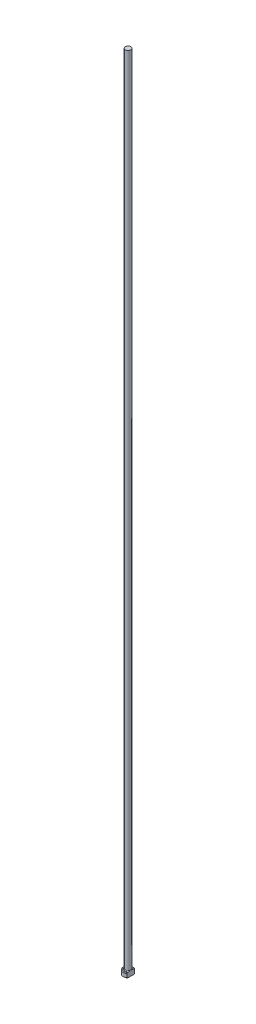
ISO-10303-21;
HEADER;
FILE_DESCRIPTION(('STEP AP214'),'2;1');
FILE_NAME('part.step','',(''),(''),'','','');
FILE_SCHEMA(('AUTOMOTIVE_DESIGN { 1 0 10303 214 1 1 1 1 }'));
ENDSEC;
DATA;
#1=APPLICATION_CONTEXT('core data for automotive mechanical design processes');
#2=APPLICATION_PROTOCOL_DEFINITION('international standard','automotive_design',2000,#1);
#3=PRODUCT_CONTEXT('',#1,'mechanical');
#4=PRODUCT('Part','Part','',(#3));
#5=PRODUCT_RELATED_PRODUCT_CATEGORY('part','',(#4));
#6=PRODUCT_DEFINITION_FORMATION('','',#4);
#7=PRODUCT_DEFINITION_CONTEXT('part definition',#1,'design');
#8=PRODUCT_DEFINITION('design','',#6,#7);
#9=PRODUCT_DEFINITION_SHAPE('','',#8);
#10=(LENGTH_UNIT() NAMED_UNIT(*) SI_UNIT(.MILLI.,.METRE.));
#11=(NAMED_UNIT(*) PLANE_ANGLE_UNIT() SI_UNIT($,.RADIAN.));
#12=(NAMED_UNIT(*) SI_UNIT($,.STERADIAN.) SOLID_ANGLE_UNIT());
#13=UNCERTAINTY_MEASURE_WITH_UNIT(LENGTH_MEASURE(1.E-05),#10,'distance_accuracy_value','');
#14=(GEOMETRIC_REPRESENTATION_CONTEXT(3) GLOBAL_UNCERTAINTY_ASSIGNED_CONTEXT((#13)) GLOBAL_UNIT_ASSIGNED_CONTEXT((#10,
#11,#12)) REPRESENTATION_CONTEXT('',''));
#15=CARTESIAN_POINT('',(0.,0.,0.));
#16=DIRECTION('',(0.,0.,1.));
#17=DIRECTION('',(1.,0.,0.));
#18=AXIS2_PLACEMENT_3D('',#15,#16,#17);
#19=CARTESIAN_POINT('',(0.,0.,0.));
#20=DIRECTION('',(0.,-1.,0.));
#21=DIRECTION('',(0.,0.,-1.));
#22=AXIS2_PLACEMENT_3D('',#19,#20,#21);
#23=PLANE('',#22);
#24=CARTESIAN_POINT('',(0.,0.,0.));
#25=DIRECTION('',(0.,-1.,0.));
#26=DIRECTION('',(0.,0.,-1.));
#27=AXIS2_PLACEMENT_3D('',#24,#25,#26);
#28=CIRCLE('',#27,1.29999999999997);
#29=CARTESIAN_POINT('',(0.849999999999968,0.,0.983615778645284));
#30=VERTEX_POINT('',#29);
#31=CARTESIAN_POINT('',(0.849999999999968,0.,-0.983615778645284));
#32=VERTEX_POINT('',#31);
#33=EDGE_CURVE('E98',#30,#32,#28,.T.);
#34=ORIENTED_EDGE('',*,*,#33,.T.);
#35=DIRECTION('',(0.,0.,1.));
#36=VECTOR('',#35,1.);
#37=CARTESIAN_POINT('',(0.849999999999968,0.,-1.23592070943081));
#38=LINE('',#37,#36);
#39=EDGE_CURVE('E83',#32,#30,#38,.T.);
#40=ORIENTED_EDGE('',*,*,#39,.T.);
#41=EDGE_LOOP('',(#34,#40));
#42=FACE_BOUND('',#41,.T.);
#43=ADVANCED_FACE('F32',(#42),#23,.T.);
#44=CARTESIAN_POINT('',(0.,259.958771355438,0.));
#45=DIRECTION('',(0.,1.,0.));
#46=DIRECTION('',(0.,0.,1.));
#47=AXIS2_PLACEMENT_3D('',#44,#45,#46);
#48=CYLINDRICAL_SURFACE('',#47,1.49999999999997);
#49=CARTESIAN_POINT('',(0.,1.29999999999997,0.));
#50=DIRECTION('',(0.,1.,0.));
#51=DIRECTION('',(0.,0.,1.));
#52=AXIS2_PLACEMENT_3D('',#49,#50,#51);
#53=CIRCLE('',#52,1.49999999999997);
#54=CARTESIAN_POINT('',(0.849999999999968,1.29999999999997,1.23592070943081));
#55=VERTEX_POINT('',#54);
#56=CARTESIAN_POINT('',(0.849999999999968,1.29999999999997,-1.23592070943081));
#57=VERTEX_POINT('',#56);
#58=EDGE_CURVE('E104',#55,#57,#53,.F.);
#59=ORIENTED_EDGE('',*,*,#58,.T.);
#60=DIRECTION('',(0.,-1.,0.));
#61=VECTOR('',#60,1.);
#62=CARTESIAN_POINT('',(0.849999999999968,250.,-1.23592070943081));
#63=LINE('',#62,#61);
#64=CARTESIAN_POINT('',(0.849999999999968,0.199999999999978,-1.23592070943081));
#65=VERTEX_POINT('',#64);
#66=EDGE_CURVE('E183',#57,#65,#63,.T.);
#67=ORIENTED_EDGE('',*,*,#66,.T.);
#68=CARTESIAN_POINT('',(0.,0.199999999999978,0.));
#69=DIRECTION('',(0.,-1.,0.));
#70=DIRECTION('',(0.,0.,-1.));
#71=AXIS2_PLACEMENT_3D('',#68,#69,#70);
#72=CIRCLE('',#71,1.49999999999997);
#73=CARTESIAN_POINT('',(0.849999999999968,0.199999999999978,1.23592070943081));
#74=VERTEX_POINT('',#73);
#75=EDGE_CURVE('E100',#65,#74,#72,.F.);
#76=ORIENTED_EDGE('',*,*,#75,.T.);
#77=DIRECTION('',(0.,-1.,0.));
#78=VECTOR('',#77,1.);
#79=CARTESIAN_POINT('',(0.849999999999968,250.,1.23592070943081));
#80=LINE('',#79,#78);
#81=EDGE_CURVE('E93',#55,#74,#80,.T.);
#82=ORIENTED_EDGE('',*,*,#81,.F.);
#83=EDGE_LOOP('',(#59,#67,#76,#82));
#84=FACE_BOUND('',#83,.T.);
#85=ADVANCED_FACE('F158',(#84),#48,.T.);
#86=CARTESIAN_POINT('',(-1.49999999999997,1.5,0.));
#87=DIRECTION('',(0.,1.,0.));
#88=DIRECTION('',(0.,0.,1.));
#89=AXIS2_PLACEMENT_3D('',#86,#87,#88);
#90=PLANE('',#89);
#91=CARTESIAN_POINT('',(0.,1.5,0.));
#92=DIRECTION('',(0.,1.,0.));
#93=DIRECTION('',(0.,0.,1.));
#94=AXIS2_PLACEMENT_3D('',#91,#92,#93);
#95=CIRCLE('',#94,1.29999999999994);
#96=CARTESIAN_POINT('',(0.849999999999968,1.5,-0.98361577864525));
#97=VERTEX_POINT('',#96);
#98=CARTESIAN_POINT('',(0.849999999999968,1.5,0.98361577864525));
#99=VERTEX_POINT('',#98);
#100=EDGE_CURVE('E178',#97,#99,#95,.T.);
#101=ORIENTED_EDGE('',*,*,#100,.T.);
#102=DIRECTION('',(0.,0.,-1.));
#103=VECTOR('',#102,1.);
#104=CARTESIAN_POINT('',(0.849999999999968,1.5,0.));
#105=LINE('',#104,#103);
#106=CARTESIAN_POINT('',(0.849999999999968,1.49999999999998,0.616441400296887));
#107=VERTEX_POINT('',#106);
#108=EDGE_CURVE('E57',#99,#107,#105,.T.);
#109=ORIENTED_EDGE('',*,*,#108,.T.);
#110=CARTESIAN_POINT('',(0.,1.5,0.));
#111=DIRECTION('',(0.,1.,0.));
#112=DIRECTION('',(0.,0.,1.));
#113=AXIS2_PLACEMENT_3D('',#110,#111,#112);
#114=CIRCLE('',#113,1.04999999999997);
#115=CARTESIAN_POINT('',(0.849999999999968,1.49999999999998,-0.616441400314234));
#116=VERTEX_POINT('',#115);
#117=EDGE_CURVE('E107',#107,#116,#114,.F.);
#118=ORIENTED_EDGE('',*,*,#117,.T.);
#119=EDGE_CURVE('E136',#116,#97,#105,.T.);
#120=ORIENTED_EDGE('',*,*,#119,.T.);
#121=EDGE_LOOP('',(#101,#109,#118,#120));
#122=FACE_BOUND('',#121,.T.);
#123=ADVANCED_FACE('F147',(#122),#90,.T.);
#124=CARTESIAN_POINT('',(0.,1.5,0.));
#125=DIRECTION('',(0.,-1.,0.));
#126=DIRECTION('',(0.,0.,-1.));
#127=AXIS2_PLACEMENT_3D('',#124,#125,#126);
#128=CONICAL_SURFACE('',#127,1.29999999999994,0.785398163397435);
#129=ORIENTED_EDGE('',*,*,#58,.F.);
#130=CARTESIAN_POINT('',(0.849999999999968,-0.0536064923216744,2.72407232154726));
#131=CARTESIAN_POINT('',(0.849999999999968,0.0399148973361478,2.62606654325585));
#132=CARTESIAN_POINT('',(0.849999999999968,0.133238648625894,2.52786853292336));
#133=CARTESIAN_POINT('',(0.849999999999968,0.319251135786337,2.33082073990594));
#134=CARTESIAN_POINT('',(0.849999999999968,0.411939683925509,2.23197078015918));
#135=CARTESIAN_POINT('',(0.849999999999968,0.597160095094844,2.03257664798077));
#136=CARTESIAN_POINT('',(0.849999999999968,0.689684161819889,1.93202522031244));
#137=CARTESIAN_POINT('',(0.849999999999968,0.873277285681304,1.72962471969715));
#138=CARTESIAN_POINT('',(0.849999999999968,0.964346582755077,1.62777586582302));
#139=CARTESIAN_POINT('',(0.849999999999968,1.10955880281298,1.46151679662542));
#140=CARTESIAN_POINT('',(0.849999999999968,1.16444529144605,1.39775756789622));
#141=CARTESIAN_POINT('',(0.849999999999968,1.27292840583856,1.26911422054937));
#142=CARTESIAN_POINT('',(0.849999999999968,1.32652466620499,1.20422979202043));
#143=CARTESIAN_POINT('',(0.849999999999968,1.43166568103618,1.07302339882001));
#144=CARTESIAN_POINT('',(0.849999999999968,1.48321432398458,1.00670456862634));
#145=CARTESIAN_POINT('',(0.849999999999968,1.58324559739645,0.871812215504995));
#146=CARTESIAN_POINT('',(0.849999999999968,1.63173001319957,0.803240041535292));
#147=CARTESIAN_POINT('',(0.849999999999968,1.71576170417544,0.674554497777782));
#148=CARTESIAN_POINT('',(0.849999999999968,1.75211002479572,0.614972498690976));
#149=CARTESIAN_POINT('',(0.849999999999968,1.81898270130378,0.492486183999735));
#150=CARTESIAN_POINT('',(0.849999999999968,1.84950605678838,0.429581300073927));
#151=CARTESIAN_POINT('',(0.849999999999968,1.89525543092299,0.31344348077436));
#152=CARTESIAN_POINT('',(0.849999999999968,1.91235250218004,0.260986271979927));
#153=CARTESIAN_POINT('',(0.849999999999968,1.93136611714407,0.180826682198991));
#154=CARTESIAN_POINT('',(0.849999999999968,1.93659539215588,0.153907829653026));
#155=CARTESIAN_POINT('',(0.849999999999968,1.94459007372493,0.099712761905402));
#156=CARTESIAN_POINT('',(0.849999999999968,1.94735676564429,0.0724367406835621));
#157=CARTESIAN_POINT('',(0.849999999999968,1.95026529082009,0.0175115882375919));
#158=CARTESIAN_POINT('',(0.849999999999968,1.95038485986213,-0.0101387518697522));
#159=CARTESIAN_POINT('',(0.849999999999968,1.94794150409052,-0.0653143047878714));
#160=CARTESIAN_POINT('',(0.849999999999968,1.94537851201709,-0.0928395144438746));
#161=CARTESIAN_POINT('',(0.849999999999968,1.93385723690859,-0.175030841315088));
#162=CARTESIAN_POINT('',(0.849999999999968,1.92106065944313,-0.229178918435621));
#163=CARTESIAN_POINT('',(0.849999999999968,1.89152127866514,-0.323067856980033));
#164=CARTESIAN_POINT('',(0.849999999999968,1.87629794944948,-0.363325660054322));
#165=CARTESIAN_POINT('',(0.849999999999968,1.84242832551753,-0.442398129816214));
#166=CARTESIAN_POINT('',(0.849999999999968,1.82377936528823,-0.481211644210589));
#167=CARTESIAN_POINT('',(0.849999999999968,1.78377495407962,-0.557941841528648));
#168=CARTESIAN_POINT('',(0.849999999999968,1.76239176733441,-0.595843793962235));
#169=CARTESIAN_POINT('',(0.849999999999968,1.71778219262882,-0.670514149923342));
#170=CARTESIAN_POINT('',(0.849999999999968,1.69455659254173,-0.707283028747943));
#171=CARTESIAN_POINT('',(0.849999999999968,1.63863584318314,-0.792218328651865));
#172=CARTESIAN_POINT('',(0.849999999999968,1.60539843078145,-0.840025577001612));
#173=CARTESIAN_POINT('',(0.849999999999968,1.53723101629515,-0.934423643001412));
#174=CARTESIAN_POINT('',(0.849999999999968,1.50230057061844,-0.98101413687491));
#175=CARTESIAN_POINT('',(0.849999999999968,1.43120159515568,-1.07330100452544));
#176=CARTESIAN_POINT('',(0.849999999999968,1.39503201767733,-1.1189965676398));
#177=CARTESIAN_POINT('',(0.849999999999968,1.32179772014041,-1.20966630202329));
#178=CARTESIAN_POINT('',(0.849999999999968,1.28473294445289,-1.25464042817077));
#179=CARTESIAN_POINT('',(0.849999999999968,1.17226420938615,-1.38904939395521));
#180=CARTESIAN_POINT('',(0.849999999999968,1.09584896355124,-1.47763652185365));
#181=CARTESIAN_POINT('',(0.849999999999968,0.941436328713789,-1.6533275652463));
#182=CARTESIAN_POINT('',(0.849999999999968,0.86343977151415,-1.7404322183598));
#183=CARTESIAN_POINT('',(0.849999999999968,0.715932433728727,-1.90311943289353));
#184=CARTESIAN_POINT('',(0.849999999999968,0.646544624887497,-1.97881368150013));
#185=CARTESIAN_POINT('',(0.849999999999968,0.507159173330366,-2.12965926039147));
#186=CARTESIAN_POINT('',(0.849999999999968,0.437161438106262,-2.20481050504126));
#187=CARTESIAN_POINT('',(0.849999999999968,0.297217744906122,-2.35416590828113));
#188=CARTESIAN_POINT('',(0.849999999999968,0.22727492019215,-2.42837300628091));
#189=CARTESIAN_POINT('',(0.849999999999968,0.0870600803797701,-2.57645011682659));
#190=CARTESIAN_POINT('',(0.849999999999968,0.016788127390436,-2.65032018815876));
#191=CARTESIAN_POINT('',(0.849999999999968,-0.0536064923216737,-2.72407232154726));
#192=B_SPLINE_CURVE_WITH_KNOTS('',3,(#130,#131,#132,#133,#134,#135,#136,#137,#138,#139,#140,
#141,#142,#143,#144,#145,#146,#147,#148,#149,#150,#151,#152,#153,#154,#155,#156,#157,#158,#159,
#160,#161,#162,#163,#164,#165,#166,#167,#168,#169,#170,#171,#172,#173,#174,#175,#176,#177,#178,
#179,#180,#181,#182,#183,#184,#185,#186,#187,#188,#189,#190,#191),.UNSPECIFIED.,.F.,.F.,(4,2,2,
2,2,2,2,2,2,2,2,2,2,2,2,2,2,2,2,2,2,2,2,2,2,2,2,2,2,2,4),(0.,0.406405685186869,
0.812926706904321,1.22284825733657,1.6327014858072,1.88507867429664,2.13752651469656,
2.38946947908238,2.64126427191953,2.85046439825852,3.05970042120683,3.22459093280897,
3.30675945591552,3.38888506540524,3.47170115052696,3.55451931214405,3.72055062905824,
3.84950358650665,3.97855731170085,4.10904305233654,4.23947329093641,4.41409453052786,
4.58876177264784,4.76358052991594,4.93841017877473,5.28934513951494,5.64010005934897,
5.94815166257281,6.25625083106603,6.56217157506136,6.86803674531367),.UNSPECIFIED.);
#193=EDGE_CURVE('E135',#55,#99,#192,.T.);
#194=ORIENTED_EDGE('',*,*,#193,.T.);
#195=ORIENTED_EDGE('',*,*,#100,.F.);
#196=EDGE_CURVE('E127',#97,#57,#192,.T.);
#197=ORIENTED_EDGE('',*,*,#196,.T.);
#198=EDGE_LOOP('',(#129,#194,#195,#197));
#199=FACE_BOUND('',#198,.T.);
#200=ADVANCED_FACE('F143',(#199),#128,.T.);
#201=CARTESIAN_POINT('',(0.,0.199999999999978,0.));
#202=DIRECTION('',(0.,1.,0.));
#203=DIRECTION('',(0.,0.,1.));
#204=AXIS2_PLACEMENT_3D('',#201,#202,#203);
#205=CONICAL_SURFACE('',#204,1.49999999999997,0.785398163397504);
#206=ORIENTED_EDGE('',*,*,#75,.F.);
#207=CARTESIAN_POINT('',(0.849999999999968,1.55360649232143,-2.72407232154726));
#208=CARTESIAN_POINT('',(0.849999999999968,1.46008510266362,-2.62606654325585));
#209=CARTESIAN_POINT('',(0.849999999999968,1.36676135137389,-2.52786853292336));
#210=CARTESIAN_POINT('',(0.849999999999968,1.18074886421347,-2.33082073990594));
#211=CARTESIAN_POINT('',(0.849999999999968,1.08806031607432,-2.23197078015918));
#212=CARTESIAN_POINT('',(0.849999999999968,0.902839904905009,-2.03257664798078));
#213=CARTESIAN_POINT('',(0.849999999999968,0.810315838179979,-1.93202522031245));
#214=CARTESIAN_POINT('',(0.849999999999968,0.626722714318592,-1.72962471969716));
#215=CARTESIAN_POINT('',(0.849999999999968,0.535653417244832,-1.62777586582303));
#216=CARTESIAN_POINT('',(0.849999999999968,0.390441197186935,-1.46151679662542));
#217=CARTESIAN_POINT('',(0.849999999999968,0.335554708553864,-1.3977575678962));
#218=CARTESIAN_POINT('',(0.849999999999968,0.22707159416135,-1.26911422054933));
#219=CARTESIAN_POINT('',(0.849999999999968,0.173475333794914,-1.20422979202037));
#220=CARTESIAN_POINT('',(0.849999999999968,0.0683343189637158,-1.07302339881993));
#221=CARTESIAN_POINT('',(0.849999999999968,0.0167856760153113,-1.00670456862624));
#222=CARTESIAN_POINT('',(0.849999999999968,-0.0832455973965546,-0.871812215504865));
#223=CARTESIAN_POINT('',(0.849999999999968,-0.131730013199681,-0.803240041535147));
#224=CARTESIAN_POINT('',(0.849999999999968,-0.215761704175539,-0.674554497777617));
#225=CARTESIAN_POINT('',(0.849999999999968,-0.252110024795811,-0.614972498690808));
#226=CARTESIAN_POINT('',(0.849999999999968,-0.318982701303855,-0.492486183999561));
#227=CARTESIAN_POINT('',(0.849999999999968,-0.349506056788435,-0.429581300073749));
#228=CARTESIAN_POINT('',(0.849999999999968,-0.395255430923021,-0.313443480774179));
#229=CARTESIAN_POINT('',(0.849999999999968,-0.412352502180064,-0.260986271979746));
#230=CARTESIAN_POINT('',(0.849999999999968,-0.431366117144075,-0.180826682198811));
#231=CARTESIAN_POINT('',(0.849999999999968,-0.436595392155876,-0.153907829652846));
#232=CARTESIAN_POINT('',(0.849999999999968,-0.444590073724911,-0.0997127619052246));
#233=CARTESIAN_POINT('',(0.849999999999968,-0.447356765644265,-0.0724367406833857));
#234=CARTESIAN_POINT('',(0.849999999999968,-0.450265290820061,-0.0175115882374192));
#235=CARTESIAN_POINT('',(0.849999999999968,-0.450384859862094,0.0101387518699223));
#236=CARTESIAN_POINT('',(0.849999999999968,-0.447941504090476,0.0653143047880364));
#237=CARTESIAN_POINT('',(0.849999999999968,-0.445378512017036,0.0928395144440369));
#238=CARTESIAN_POINT('',(0.849999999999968,-0.43385723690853,0.175030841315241));
#239=CARTESIAN_POINT('',(0.849999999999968,-0.421060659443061,0.229178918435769));
#240=CARTESIAN_POINT('',(0.849999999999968,-0.391521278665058,0.323067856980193));
#241=CARTESIAN_POINT('',(0.849999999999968,-0.376297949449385,0.363325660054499));
#242=CARTESIAN_POINT('',(0.849999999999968,-0.342428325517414,0.442398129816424));
#243=CARTESIAN_POINT('',(0.849999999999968,-0.323779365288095,0.481211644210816));
#244=CARTESIAN_POINT('',(0.849999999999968,-0.28377495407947,0.557941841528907));
#245=CARTESIAN_POINT('',(0.849999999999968,-0.262391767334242,0.59584379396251));
#246=CARTESIAN_POINT('',(0.849999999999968,-0.217782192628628,0.670514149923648));
#247=CARTESIAN_POINT('',(0.849999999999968,-0.194556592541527,0.707283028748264));
#248=CARTESIAN_POINT('',(0.849999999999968,-0.138635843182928,0.792218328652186));
#249=CARTESIAN_POINT('',(0.849999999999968,-0.105398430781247,0.840025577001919));
#250=CARTESIAN_POINT('',(0.849999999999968,-0.0372310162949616,0.934423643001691));
#251=CARTESIAN_POINT('',(0.849999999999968,-0.00230057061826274,0.981014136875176));
#252=CARTESIAN_POINT('',(0.849999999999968,0.0687984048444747,1.07330100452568));
#253=CARTESIAN_POINT('',(0.849999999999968,0.104967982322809,1.11899656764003));
#254=CARTESIAN_POINT('',(0.849999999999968,0.178202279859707,1.2096663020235));
#255=CARTESIAN_POINT('',(0.849999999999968,0.215267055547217,1.25464042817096));
#256=CARTESIAN_POINT('',(0.849999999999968,0.327735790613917,1.38904939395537));
#257=CARTESIAN_POINT('',(0.849999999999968,0.404151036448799,1.47763652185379));
#258=CARTESIAN_POINT('',(0.849999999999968,0.558563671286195,1.6533275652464));
#259=CARTESIAN_POINT('',(0.849999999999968,0.636560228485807,1.74043221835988));
#260=CARTESIAN_POINT('',(0.849999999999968,0.784067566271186,1.90311943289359));
#261=CARTESIAN_POINT('',(0.849999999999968,0.853455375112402,1.97881368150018));
#262=CARTESIAN_POINT('',(0.849999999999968,0.992840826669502,2.1296592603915));
#263=CARTESIAN_POINT('',(0.849999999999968,1.06283856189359,2.20481050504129));
#264=CARTESIAN_POINT('',(0.849999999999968,1.2027822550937,2.35416590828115));
#265=CARTESIAN_POINT('',(0.849999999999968,1.27272507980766,2.42837300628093));
#266=CARTESIAN_POINT('',(0.849999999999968,1.41293991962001,2.5764501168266));
#267=CARTESIAN_POINT('',(0.849999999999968,1.48321187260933,2.65032018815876));
#268=CARTESIAN_POINT('',(0.849999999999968,1.55360649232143,2.72407232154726));
#269=B_SPLINE_CURVE_WITH_KNOTS('',3,(#207,#208,#209,#210,#211,#212,#213,#214,#215,#216,#217,
#218,#219,#220,#221,#222,#223,#224,#225,#226,#227,#228,#229,#230,#231,#232,#233,#234,#235,#236,
#237,#238,#239,#240,#241,#242,#243,#244,#245,#246,#247,#248,#249,#250,#251,#252,#253,#254,#255,
#256,#257,#258,#259,#260,#261,#262,#263,#264,#265,#266,#267,#268),.UNSPECIFIED.,.F.,.F.,(4,2,2,
2,2,2,2,2,2,2,2,2,2,2,2,2,2,2,2,2,2,2,2,2,2,2,2,2,2,2,4),(0.,0.406405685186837,
0.812926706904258,1.22284825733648,1.63270148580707,1.88507867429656,2.13752651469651,
2.38946947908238,2.64126427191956,2.85046439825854,3.05970042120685,3.22459093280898,
3.30675945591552,3.38888506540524,3.47170115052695,3.55451931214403,3.72055062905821,
3.84950358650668,3.97855731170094,4.10904305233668,4.23947329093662,4.41409453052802,
4.58876177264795,4.763580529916,4.93841017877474,5.28934513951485,5.64010005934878,
5.94815166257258,6.25625083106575,6.56217157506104,6.86803674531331),.UNSPECIFIED.);
#270=EDGE_CURVE('E86',#65,#32,#269,.T.);
#271=ORIENTED_EDGE('',*,*,#270,.T.);
#272=ORIENTED_EDGE('',*,*,#33,.F.);
#273=EDGE_CURVE('E89',#30,#74,#269,.T.);
#274=ORIENTED_EDGE('',*,*,#273,.T.);
#275=EDGE_LOOP('',(#206,#271,#272,#274));
#276=FACE_BOUND('',#275,.T.);
#277=ADVANCED_FACE('F97',(#276),#205,.T.);
#278=CARTESIAN_POINT('',(0.,1.69999999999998,0.));
#279=DIRECTION('',(0.,1.,0.));
#280=DIRECTION('',(0.,0.,1.));
#281=AXIS2_PLACEMENT_3D('',#278,#279,#280);
#282=TOROIDAL_SURFACE('',#281,1.04999999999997,0.2);
#283=CARTESIAN_POINT('',(0.849999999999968,1.69999999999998,0.));
#284=CARTESIAN_POINT('',(0.849999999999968,1.70000051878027,-9.40181058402E-12));
#285=CARTESIAN_POINT('',(0.849999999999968,1.70000103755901,-8.53981725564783E-08));
#286=CARTESIAN_POINT('',(0.849999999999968,1.70000204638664,-3.68295676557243E-07));
#287=CARTESIAN_POINT('',(0.849999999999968,1.70000253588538,-5.67473109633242E-07));
#288=CARTESIAN_POINT('',(0.849999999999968,1.70000350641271,-1.05059094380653E-06));
#289=CARTESIAN_POINT('',(0.849999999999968,1.70000398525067,-1.33882692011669E-06));
#290=CARTESIAN_POINT('',(0.849999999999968,1.7000049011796,-1.96944630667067E-06));
#291=CARTESIAN_POINT('',(0.849999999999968,1.70000533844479,-2.31158620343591E-06));
#292=CARTESIAN_POINT('',(0.849999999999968,1.70000675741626,-3.51016254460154E-06));
#293=CARTESIAN_POINT('',(0.849999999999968,1.70000767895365,-4.43847621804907E-06));
#294=CARTESIAN_POINT('',(0.849999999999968,1.70000936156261,-6.38697155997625E-06));
#295=CARTESIAN_POINT('',(0.849999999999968,1.7000101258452,-7.40454028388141E-06));
#296=CARTESIAN_POINT('',(0.849999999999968,1.70001287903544,-1.12525915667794E-05));
#297=CARTESIAN_POINT('',(0.849999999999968,1.70001471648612,-1.41948048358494E-05));
#298=CARTESIAN_POINT('',(0.849999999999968,1.70001783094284,-2.00941117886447E-05));
#299=CARTESIAN_POINT('',(0.849999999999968,1.7000191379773,-2.30360250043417E-05));
#300=CARTESIAN_POINT('',(0.849999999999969,1.700024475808,-3.52043664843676E-05));
#301=CARTESIAN_POINT('',(0.849999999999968,1.70002838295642,-4.4479803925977E-05));
#302=CARTESIAN_POINT('',(0.849999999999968,1.70003486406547,-6.20583674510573E-05));
#303=CARTESIAN_POINT('',(0.849999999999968,1.70003754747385,-7.03197985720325E-05));
#304=CARTESIAN_POINT('',(0.849999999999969,1.70005819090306,-0.000128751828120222));
#305=CARTESIAN_POINT('',(0.849999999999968,1.70008371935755,-0.000175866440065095));
#306=CARTESIAN_POINT('',(0.849999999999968,1.70017804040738,-0.000356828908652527));
#307=CARTESIAN_POINT('',(0.849999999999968,1.70024121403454,-0.000492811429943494));
#308=CARTESIAN_POINT('',(0.849999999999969,1.70048655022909,-0.00101279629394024));
#309=CARTESIAN_POINT('',(0.849999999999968,1.70067459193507,-0.0013945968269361));
#310=CARTESIAN_POINT('',(0.849999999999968,1.7014276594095,-0.00293145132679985));
#311=CARTESIAN_POINT('',(0.849999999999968,1.70198609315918,-0.0040889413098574));
#312=CARTESIAN_POINT('',(0.849999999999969,1.71043533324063,-0.0215925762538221));
#313=CARTESIAN_POINT('',(0.849999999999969,1.71837727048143,-0.0379203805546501));
#314=CARTESIAN_POINT('',(0.849999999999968,1.7338686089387,-0.0700737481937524));
#315=CARTESIAN_POINT('',(0.849999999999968,1.74142215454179,-0.0858974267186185));
#316=CARTESIAN_POINT('',(0.849999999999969,1.75718253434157,-0.119339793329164));
#317=CARTESIAN_POINT('',(0.849999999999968,1.76537140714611,-0.136967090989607));
#318=CARTESIAN_POINT('',(0.849999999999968,1.78150993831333,-0.172531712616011));
#319=CARTESIAN_POINT('',(0.849999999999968,1.78945661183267,-0.190470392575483));
#320=CARTESIAN_POINT('',(0.849999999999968,1.80890508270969,-0.23585761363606));
#321=CARTESIAN_POINT('',(0.849999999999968,1.8201219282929,-0.263430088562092));
#322=CARTESIAN_POINT('',(0.849999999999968,1.84085119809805,-0.31855841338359));
#323=CARTESIAN_POINT('',(0.849999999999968,1.85039454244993,-0.346102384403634));
#324=CARTESIAN_POINT('',(0.849999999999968,1.86376741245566,-0.389594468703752));
#325=CARTESIAN_POINT('',(0.849999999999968,1.86826823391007,-0.405334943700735));
#326=CARTESIAN_POINT('',(0.849999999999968,1.87655535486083,-0.437077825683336));
#327=CARTESIAN_POINT('',(0.849999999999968,1.8803382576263,-0.453081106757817));
#328=CARTESIAN_POINT('',(0.849999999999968,1.8907100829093,-0.502906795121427));
#329=CARTESIAN_POINT('',(0.849999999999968,1.89584064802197,-0.537068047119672));
#330=CARTESIAN_POINT('',(0.849999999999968,1.90023986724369,-0.59774723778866));
#331=CARTESIAN_POINT('',(0.849999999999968,1.90059986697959,-0.624181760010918));
#332=CARTESIAN_POINT('',(0.849999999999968,1.89734237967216,-0.676523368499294));
#333=CARTESIAN_POINT('',(0.849999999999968,1.89377863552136,-0.702432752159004));
#334=CARTESIAN_POINT('',(0.849999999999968,1.88404638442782,-0.743149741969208));
#335=CARTESIAN_POINT('',(0.849999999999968,1.87944517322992,-0.758330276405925));
#336=CARTESIAN_POINT('',(0.849999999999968,1.86810073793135,-0.787921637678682));
#337=CARTESIAN_POINT('',(0.849999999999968,1.86135499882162,-0.802331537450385));
#338=CARTESIAN_POINT('',(0.849999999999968,1.84721190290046,-0.826746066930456));
#339=CARTESIAN_POINT('',(0.849999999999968,1.84028561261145,-0.837021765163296));
#340=CARTESIAN_POINT('',(0.849999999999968,1.82488560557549,-0.856339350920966));
#341=CARTESIAN_POINT('',(0.849999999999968,1.8164148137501,-0.86538351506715));
#342=CARTESIAN_POINT('',(0.849999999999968,1.79993436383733,-0.879978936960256));
#343=CARTESIAN_POINT('',(0.849999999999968,1.79222027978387,-0.885862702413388));
#344=CARTESIAN_POINT('',(0.849999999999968,1.77592760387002,-0.896293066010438));
#345=CARTESIAN_POINT('',(0.849999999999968,1.76734935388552,-0.900840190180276));
#346=CARTESIAN_POINT('',(0.849999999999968,1.74943887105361,-0.908347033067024));
#347=CARTESIAN_POINT('',(0.849999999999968,1.74010143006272,-0.911294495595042));
#348=CARTESIAN_POINT('',(0.849999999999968,1.7210315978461,-0.91532157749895));
#349=CARTESIAN_POINT('',(0.849999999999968,1.71129950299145,-0.916402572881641));
#350=CARTESIAN_POINT('',(0.849999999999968,1.69303591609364,-0.916598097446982));
#351=CARTESIAN_POINT('',(0.849999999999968,1.68450611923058,-0.915941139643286));
#352=CARTESIAN_POINT('',(0.849999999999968,1.667687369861,-0.913176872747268));
#353=CARTESIAN_POINT('',(0.849999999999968,1.65939839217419,-0.911069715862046));
#354=CARTESIAN_POINT('',(0.849999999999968,1.64340816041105,-0.905576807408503));
#355=CARTESIAN_POINT('',(0.849999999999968,1.63569966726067,-0.902211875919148));
#356=CARTESIAN_POINT('',(0.849999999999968,1.62087356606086,-0.894372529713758));
#357=CARTESIAN_POINT('',(0.849999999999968,1.61375616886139,-0.889897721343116));
#358=CARTESIAN_POINT('',(0.849999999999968,1.59761508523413,-0.87813790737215));
#359=CARTESIAN_POINT('',(0.849999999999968,1.58889769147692,-0.870431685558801));
#360=CARTESIAN_POINT('',(0.849999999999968,1.5728293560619,-0.853701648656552));
#361=CARTESIAN_POINT('',(0.849999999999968,1.56548157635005,-0.84467486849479));
#362=CARTESIAN_POINT('',(0.849999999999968,1.54959009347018,-0.822072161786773));
#363=CARTESIAN_POINT('',(0.849999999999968,1.5416531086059,-0.808071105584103));
#364=CARTESIAN_POINT('',(0.849999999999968,1.52810899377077,-0.77903495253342));
#365=CARTESIAN_POINT('',(0.849999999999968,1.52250055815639,-0.764000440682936));
#366=CARTESIAN_POINT('',(0.849999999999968,1.51092301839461,-0.725431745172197));
#367=CARTESIAN_POINT('',(0.849999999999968,1.50625689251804,-0.7015093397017));
#368=CARTESIAN_POINT('',(0.849999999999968,1.50057784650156,-0.65298680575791));
#369=CARTESIAN_POINT('',(0.849999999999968,1.49961383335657,-0.628381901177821));
#370=CARTESIAN_POINT('',(0.849999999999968,1.50106390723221,-0.560102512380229));
#371=CARTESIAN_POINT('',(0.849999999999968,1.50669397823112,-0.516501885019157));
#372=CARTESIAN_POINT('',(0.849999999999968,1.51953102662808,-0.453258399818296));
#373=CARTESIAN_POINT('',(0.849999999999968,1.52436540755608,-0.433034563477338));
#374=CARTESIAN_POINT('',(0.849999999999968,1.53515534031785,-0.393001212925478));
#375=CARTESIAN_POINT('',(0.849999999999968,1.54110441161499,-0.373190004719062));
#376=CARTESIAN_POINT('',(0.849999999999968,1.55603600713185,-0.327373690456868));
#377=CARTESIAN_POINT('',(0.849999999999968,1.56537124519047,-0.301485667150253));
#378=CARTESIAN_POINT('',(0.849999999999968,1.58544986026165,-0.249610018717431));
#379=CARTESIAN_POINT('',(0.849999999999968,1.59621976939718,-0.2236328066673));
#380=CARTESIAN_POINT('',(0.849999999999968,1.61482171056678,-0.180777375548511));
#381=CARTESIAN_POINT('',(0.849999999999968,1.62241504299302,-0.163793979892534));
#382=CARTESIAN_POINT('',(0.849999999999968,1.63780310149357,-0.130109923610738));
#383=CARTESIAN_POINT('',(0.849999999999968,1.64559528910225,-0.113408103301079));
#384=CARTESIAN_POINT('',(0.849999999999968,1.66057370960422,-0.0817127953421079));
#385=CARTESIAN_POINT('',(0.849999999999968,1.66774468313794,-0.0667119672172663));
#386=CARTESIAN_POINT('',(0.849999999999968,1.68244267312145,-0.0362276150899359));
#387=CARTESIAN_POINT('',(0.849999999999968,1.68997332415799,-0.020745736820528));
#388=CARTESIAN_POINT('',(0.849999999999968,1.69801386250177,-0.00408905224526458));
#389=CARTESIAN_POINT('',(0.849999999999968,1.69857223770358,-0.00293166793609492));
#390=CARTESIAN_POINT('',(0.849999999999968,1.69932528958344,-0.00139484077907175));
#391=CARTESIAN_POINT('',(0.849999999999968,1.69951337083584,-0.00101296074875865));
#392=CARTESIAN_POINT('',(0.849999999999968,1.69975875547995,-0.000492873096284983));
#393=CARTESIAN_POINT('',(0.849999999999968,1.69982193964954,-0.000356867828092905));
#394=CARTESIAN_POINT('',(0.849999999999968,1.6999162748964,-0.000175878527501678));
#395=CARTESIAN_POINT('',(0.849999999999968,1.6999418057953,-0.000128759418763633));
#396=CARTESIAN_POINT('',(0.849999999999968,1.69996245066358,-7.03220999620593E-05));
#397=CARTESIAN_POINT('',(0.849999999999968,1.69996513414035,-6.20602802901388E-05));
#398=CARTESIAN_POINT('',(0.849999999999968,1.69997161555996,-4.44808855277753E-05));
#399=CARTESIAN_POINT('',(0.849999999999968,1.69997552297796,-3.52050155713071E-05));
#400=CARTESIAN_POINT('',(0.849999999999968,1.6999808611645,-2.30361869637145E-05));
#401=CARTESIAN_POINT('',(0.849999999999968,1.69998216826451,-2.00942075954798E-05));
#402=CARTESIAN_POINT('',(0.849999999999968,1.69998528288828,-1.41947798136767E-05));
#403=CARTESIAN_POINT('',(0.849999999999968,1.69998712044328,-1.12525137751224E-05));
#404=CARTESIAN_POINT('',(0.849999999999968,1.6999898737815,-7.40441477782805E-06));
#405=CARTESIAN_POINT('',(0.849999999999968,1.69999063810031,-6.38684057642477E-06));
#406=CARTESIAN_POINT('',(0.849999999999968,1.69999232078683,-4.4383417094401E-06));
#407=CARTESIAN_POINT('',(0.849999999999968,1.69999324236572,-3.51003022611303E-06));
#408=CARTESIAN_POINT('',(0.849999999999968,1.69999466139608,-2.3114658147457E-06));
#409=CARTESIAN_POINT('',(0.849999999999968,1.69999509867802,-1.96933111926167E-06));
#410=CARTESIAN_POINT('',(0.849999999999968,1.69999601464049,-1.338725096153E-06));
#411=CARTESIAN_POINT('',(0.849999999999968,1.69999649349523,-1.05049730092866E-06));
#412=CARTESIAN_POINT('',(0.849999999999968,1.69999746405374,-5.67399370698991E-07));
#413=CARTESIAN_POINT('',(0.849999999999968,1.69999795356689,-3.68233376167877E-07));
#414=CARTESIAN_POINT('',(0.849999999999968,1.69999896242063,-8.53633970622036E-08));
#415=CARTESIAN_POINT('',(0.849999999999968,1.69999948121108,9.40196651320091E-12));
#416=CARTESIAN_POINT('',(0.849999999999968,1.69999999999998,0.));
#417=B_SPLINE_CURVE_WITH_KNOTS('',3,(#283,#284,#285,#286,#287,#288,#289,#290,#291,#292,#293,
#294,#295,#296,#297,#298,#299,#300,#301,#302,#303,#304,#305,#306,#307,#308,#309,#310,#311,#312,
#313,#314,#315,#316,#317,#318,#319,#320,#321,#322,#323,#324,#325,#326,#327,#328,#329,#330,#331,
#332,#333,#334,#335,#336,#337,#338,#339,#340,#341,#342,#343,#344,#345,#346,#347,#348,#349,#350,
#351,#352,#353,#354,#355,#356,#357,#358,#359,#360,#361,#362,#363,#364,#365,#366,#367,#368,#369,
#370,#371,#372,#373,#374,#375,#376,#377,#378,#379,#380,#381,#382,#383,#384,#385,#386,#387,#388,
#389,#390,#391,#392,#393,#394,#395,#396,#397,#398,#399,#400,#401,#402,#403,#404,#405,#406,#407,
#408,#409,#410,#411,#412,#413,#414,#415,#416),.UNSPECIFIED.,.T.,.F.,(4,2,2,2,2,2,2,2,2,2,2,2,2,
2,2,2,2,2,2,2,2,2,2,2,2,2,2,2,2,2,2,2,2,2,2,2,2,2,2,2,2,2,2,2,2,2,2,2,2,2,2,2,2,2,2,2,2,2,2,2,2,
2,2,2,2,2,4),(0.,1.55468737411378E-06,3.13278180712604E-06,4.80367222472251E-06,
6.46722002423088E-06,1.03719688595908E-05,1.41866502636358E-05,2.45537684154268E-05,
3.42019719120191E-05,6.43851505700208E-05,9.04176825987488E-05,0.000250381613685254,
0.00070083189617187,0.00197684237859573,0.0058331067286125,0.060296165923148,0.112899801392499,
0.171206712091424,0.230063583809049,0.319335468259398,0.406727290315,0.455824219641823,
0.505147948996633,0.608437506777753,0.687539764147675,0.765571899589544,0.81303553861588,
0.860555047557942,0.897604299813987,0.934584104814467,0.96357666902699,0.992557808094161,
1.02175796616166,1.05093658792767,1.0764748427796,1.10201041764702,1.12714077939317,
1.15228006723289,1.18699327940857,1.2217856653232,1.26980034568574,1.31778806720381,
1.39050031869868,1.4641699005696,1.59521965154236,1.65759205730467,1.71961250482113,
1.80213235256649,1.8864735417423,1.94228209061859,1.99757019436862,2.047451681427,
2.09909333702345,2.10294924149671,2.10422551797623,2.10467604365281,2.10483602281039,
2.10486205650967,2.10489224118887,2.10490188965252,2.10491225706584,2.10491607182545,
2.10491997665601,2.10492164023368,2.10492331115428,2.10492488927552,2.10492644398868),.UNSPECIFIED.);
#418=CARTESIAN_POINT('',(0.849999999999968,1.69999999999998,0.));
#419=VERTEX_POINT('',#418);
#420=EDGE_CURVE('E11',#116,#419,#417,.T.);
#421=ORIENTED_EDGE('',*,*,#420,.F.);
#422=ORIENTED_EDGE('',*,*,#117,.F.);
#423=CARTESIAN_POINT('',(0.849999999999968,1.69999999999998,0.));
#424=CARTESIAN_POINT('',(0.849999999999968,1.69999948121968,9.40181404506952E-12));
#425=CARTESIAN_POINT('',(0.849999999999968,1.69999896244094,8.53981725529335E-08));
#426=CARTESIAN_POINT('',(0.849999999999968,1.69999795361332,3.68295676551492E-07));
#427=CARTESIAN_POINT('',(0.849999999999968,1.69999746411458,5.67473109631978E-07));
#428=CARTESIAN_POINT('',(0.849999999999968,1.69999649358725,1.05059094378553E-06));
#429=CARTESIAN_POINT('',(0.849999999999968,1.69999601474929,1.33882692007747E-06));
#430=CARTESIAN_POINT('',(0.849999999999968,1.69999509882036,1.96944630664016E-06));
#431=CARTESIAN_POINT('',(0.849999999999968,1.69999466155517,2.31158620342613E-06));
#432=CARTESIAN_POINT('',(0.849999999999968,1.6999932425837,3.51016254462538E-06));
#433=CARTESIAN_POINT('',(0.849999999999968,1.6999923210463,4.43847621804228E-06));
#434=CARTESIAN_POINT('',(0.849999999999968,1.69999063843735,6.38697155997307E-06));
#435=CARTESIAN_POINT('',(0.849999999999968,1.69998987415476,7.4045402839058E-06));
#436=CARTESIAN_POINT('',(0.849999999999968,1.69998712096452,1.12525915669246E-05));
#437=CARTESIAN_POINT('',(0.849999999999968,1.69998528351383,1.41948048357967E-05));
#438=CARTESIAN_POINT('',(0.849999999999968,1.69998216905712,2.0094111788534E-05));
#439=CARTESIAN_POINT('',(0.849999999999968,1.69998086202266,2.30360250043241E-05));
#440=CARTESIAN_POINT('',(0.849999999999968,1.69997552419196,3.52043664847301E-05));
#441=CARTESIAN_POINT('',(0.849999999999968,1.69997161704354,4.44798039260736E-05));
#442=CARTESIAN_POINT('',(0.849999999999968,1.69996513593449,6.20583674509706E-05));
#443=CARTESIAN_POINT('',(0.849999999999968,1.69996245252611,7.03197985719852E-05));
#444=CARTESIAN_POINT('',(0.849999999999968,1.6999418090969,0.000128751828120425));
#445=CARTESIAN_POINT('',(0.849999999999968,1.69991628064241,0.000175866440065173));
#446=CARTESIAN_POINT('',(0.849999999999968,1.69982195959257,0.000356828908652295));
#447=CARTESIAN_POINT('',(0.849999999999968,1.69975878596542,0.000492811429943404));
#448=CARTESIAN_POINT('',(0.849999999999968,1.69951344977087,0.00101279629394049));
#449=CARTESIAN_POINT('',(0.849999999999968,1.69932540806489,0.00139459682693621));
#450=CARTESIAN_POINT('',(0.849999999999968,1.69857234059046,0.00293145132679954));
#451=CARTESIAN_POINT('',(0.849999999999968,1.69801390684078,0.00408894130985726));
#452=CARTESIAN_POINT('',(0.849999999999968,1.68956466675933,0.0215925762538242));
#453=CARTESIAN_POINT('',(0.849999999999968,1.68162272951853,0.0379203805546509));
#454=CARTESIAN_POINT('',(0.849999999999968,1.66613139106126,0.0700737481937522));
#455=CARTESIAN_POINT('',(0.849999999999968,1.65857784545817,0.0858974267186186));
#456=CARTESIAN_POINT('',(0.849999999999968,1.64281746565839,0.119339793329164));
#457=CARTESIAN_POINT('',(0.849999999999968,1.63462859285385,0.136967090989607));
#458=CARTESIAN_POINT('',(0.849999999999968,1.61849006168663,0.172531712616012));
#459=CARTESIAN_POINT('',(0.849999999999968,1.61054338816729,0.190470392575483));
#460=CARTESIAN_POINT('',(0.849999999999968,1.59109491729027,0.23585761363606));
#461=CARTESIAN_POINT('',(0.849999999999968,1.57987807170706,0.263430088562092));
#462=CARTESIAN_POINT('',(0.849999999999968,1.55914880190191,0.31855841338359));
#463=CARTESIAN_POINT('',(0.849999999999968,1.54960545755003,0.346102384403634));
#464=CARTESIAN_POINT('',(0.849999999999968,1.5362325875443,0.389594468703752));
#465=CARTESIAN_POINT('',(0.849999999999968,1.53173176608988,0.405334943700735));
#466=CARTESIAN_POINT('',(0.849999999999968,1.52344464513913,0.437077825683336));
#467=CARTESIAN_POINT('',(0.849999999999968,1.51966174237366,0.453081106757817));
#468=CARTESIAN_POINT('',(0.849999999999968,1.50928991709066,0.502906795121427));
#469=CARTESIAN_POINT('',(0.849999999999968,1.50415935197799,0.537068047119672));
#470=CARTESIAN_POINT('',(0.849999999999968,1.49976013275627,0.59774723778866));
#471=CARTESIAN_POINT('',(0.849999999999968,1.49940013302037,0.624181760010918));
#472=CARTESIAN_POINT('',(0.849999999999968,1.5026576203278,0.676523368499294));
#473=CARTESIAN_POINT('',(0.849999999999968,1.5062213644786,0.702432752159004));
#474=CARTESIAN_POINT('',(0.849999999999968,1.51595361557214,0.743149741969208));
#475=CARTESIAN_POINT('',(0.849999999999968,1.52055482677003,0.758330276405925));
#476=CARTESIAN_POINT('',(0.849999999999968,1.53189926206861,0.787921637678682));
#477=CARTESIAN_POINT('',(0.849999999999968,1.53864500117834,0.802331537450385));
#478=CARTESIAN_POINT('',(0.849999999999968,1.5527880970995,0.826746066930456));
#479=CARTESIAN_POINT('',(0.849999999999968,1.55971438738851,0.837021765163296));
#480=CARTESIAN_POINT('',(0.849999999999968,1.57511439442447,0.856339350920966));
#481=CARTESIAN_POINT('',(0.849999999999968,1.58358518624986,0.86538351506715));
#482=CARTESIAN_POINT('',(0.849999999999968,1.60006563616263,0.879978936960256));
#483=CARTESIAN_POINT('',(0.849999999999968,1.60777972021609,0.885862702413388));
#484=CARTESIAN_POINT('',(0.849999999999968,1.62407239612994,0.896293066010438));
#485=CARTESIAN_POINT('',(0.849999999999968,1.63265064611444,0.900840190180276));
#486=CARTESIAN_POINT('',(0.849999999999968,1.65056112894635,0.908347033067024));
#487=CARTESIAN_POINT('',(0.849999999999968,1.65989856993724,0.911294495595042));
#488=CARTESIAN_POINT('',(0.849999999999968,1.67896840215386,0.91532157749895));
#489=CARTESIAN_POINT('',(0.849999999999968,1.68870049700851,0.916402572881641));
#490=CARTESIAN_POINT('',(0.849999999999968,1.70696408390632,0.916598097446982));
#491=CARTESIAN_POINT('',(0.849999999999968,1.71549388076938,0.915941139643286));
#492=CARTESIAN_POINT('',(0.849999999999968,1.73231263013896,0.913176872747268));
#493=CARTESIAN_POINT('',(0.849999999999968,1.74060160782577,0.911069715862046));
#494=CARTESIAN_POINT('',(0.849999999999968,1.75659183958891,0.905576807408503));
#495=CARTESIAN_POINT('',(0.849999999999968,1.76430033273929,0.902211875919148));
#496=CARTESIAN_POINT('',(0.849999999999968,1.7791264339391,0.894372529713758));
#497=CARTESIAN_POINT('',(0.849999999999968,1.78624383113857,0.889897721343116));
#498=CARTESIAN_POINT('',(0.849999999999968,1.80238491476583,0.87813790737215));
#499=CARTESIAN_POINT('',(0.849999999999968,1.81110230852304,0.870431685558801));
#500=CARTESIAN_POINT('',(0.849999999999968,1.82717064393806,0.853701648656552));
#501=CARTESIAN_POINT('',(0.849999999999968,1.83451842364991,0.84467486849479));
#502=CARTESIAN_POINT('',(0.849999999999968,1.85040990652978,0.822072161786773));
#503=CARTESIAN_POINT('',(0.849999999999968,1.85834689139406,0.808071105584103));
#504=CARTESIAN_POINT('',(0.849999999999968,1.87189100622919,0.77903495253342));
#505=CARTESIAN_POINT('',(0.849999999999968,1.87749944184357,0.764000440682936));
#506=CARTESIAN_POINT('',(0.849999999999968,1.88907698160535,0.725431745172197));
#507=CARTESIAN_POINT('',(0.849999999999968,1.89374310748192,0.7015093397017));
#508=CARTESIAN_POINT('',(0.849999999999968,1.8994221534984,0.65298680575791));
#509=CARTESIAN_POINT('',(0.849999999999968,1.90038616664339,0.628381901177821));
#510=CARTESIAN_POINT('',(0.849999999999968,1.89893609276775,0.560102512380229));
#511=CARTESIAN_POINT('',(0.849999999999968,1.89330602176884,0.516501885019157));
#512=CARTESIAN_POINT('',(0.849999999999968,1.88046897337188,0.453258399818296));
#513=CARTESIAN_POINT('',(0.849999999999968,1.87563459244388,0.433034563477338));
#514=CARTESIAN_POINT('',(0.849999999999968,1.86484465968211,0.393001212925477));
#515=CARTESIAN_POINT('',(0.849999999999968,1.85889558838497,0.373190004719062));
#516=CARTESIAN_POINT('',(0.849999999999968,1.84396399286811,0.327373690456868));
#517=CARTESIAN_POINT('',(0.849999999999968,1.83462875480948,0.301485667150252));
#518=CARTESIAN_POINT('',(0.849999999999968,1.8145501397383,0.249610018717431));
#519=CARTESIAN_POINT('',(0.849999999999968,1.80378023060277,0.2236328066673));
#520=CARTESIAN_POINT('',(0.849999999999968,1.78517828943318,0.18077737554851));
#521=CARTESIAN_POINT('',(0.849999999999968,1.77758495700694,0.163793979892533));
#522=CARTESIAN_POINT('',(0.849999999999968,1.76219689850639,0.130109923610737));
#523=CARTESIAN_POINT('',(0.849999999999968,1.75440471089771,0.113408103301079));
#524=CARTESIAN_POINT('',(0.849999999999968,1.73942629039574,0.0817127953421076));
#525=CARTESIAN_POINT('',(0.849999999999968,1.73225531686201,0.0667119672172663));
#526=CARTESIAN_POINT('',(0.849999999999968,1.71755732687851,0.0362276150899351));
#527=CARTESIAN_POINT('',(0.849999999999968,1.71002667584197,0.0207457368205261));
#528=CARTESIAN_POINT('',(0.849999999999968,1.70198613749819,0.00408905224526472));
#529=CARTESIAN_POINT('',(0.849999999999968,1.70142776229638,0.0029316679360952));
#530=CARTESIAN_POINT('',(0.849999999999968,1.70067471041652,0.00139484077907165));
#531=CARTESIAN_POINT('',(0.849999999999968,1.70048662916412,0.00101296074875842));
#532=CARTESIAN_POINT('',(0.849999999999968,1.70024124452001,0.000492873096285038));
#533=CARTESIAN_POINT('',(0.849999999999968,1.70017806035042,0.00035686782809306));
#534=CARTESIAN_POINT('',(0.849999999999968,1.70008372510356,0.000175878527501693));
#535=CARTESIAN_POINT('',(0.849999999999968,1.70005819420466,0.000128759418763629));
#536=CARTESIAN_POINT('',(0.849999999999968,1.70003754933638,7.03220999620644E-05));
#537=CARTESIAN_POINT('',(0.849999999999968,1.70003486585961,6.20602802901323E-05));
#538=CARTESIAN_POINT('',(0.849999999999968,1.70002838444,4.44808855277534E-05));
#539=CARTESIAN_POINT('',(0.849999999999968,1.700024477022,3.5205015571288E-05));
#540=CARTESIAN_POINT('',(0.849999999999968,1.70001913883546,2.30361869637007E-05));
#541=CARTESIAN_POINT('',(0.849999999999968,1.70001783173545,2.0094207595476E-05));
#542=CARTESIAN_POINT('',(0.849999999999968,1.70001471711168,1.41947798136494E-05));
#543=CARTESIAN_POINT('',(0.849999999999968,1.70001287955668,1.12525137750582E-05));
#544=CARTESIAN_POINT('',(0.849999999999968,1.70001012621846,7.40441477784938E-06));
#545=CARTESIAN_POINT('',(0.849999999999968,1.70000936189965,6.38684057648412E-06));
#546=CARTESIAN_POINT('',(0.849999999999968,1.70000767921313,4.43834170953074E-06));
#547=CARTESIAN_POINT('',(0.849999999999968,1.70000675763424,3.51003022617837E-06));
#548=CARTESIAN_POINT('',(0.849999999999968,1.70000533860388,2.31146581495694E-06));
#549=CARTESIAN_POINT('',(0.849999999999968,1.70000490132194,1.96933111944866E-06));
#550=CARTESIAN_POINT('',(0.849999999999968,1.70000398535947,1.33872509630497E-06));
#551=CARTESIAN_POINT('',(0.849999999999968,1.70000350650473,1.05049730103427E-06));
#552=CARTESIAN_POINT('',(0.849999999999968,1.70000253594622,5.67399370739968E-07));
#553=CARTESIAN_POINT('',(0.849999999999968,1.70000204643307,3.68233376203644E-07));
#554=CARTESIAN_POINT('',(0.849999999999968,1.70000103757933,8.53633970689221E-08));
#555=CARTESIAN_POINT('',(0.849999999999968,1.70000051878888,-9.40196997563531E-12));
#556=CARTESIAN_POINT('',(0.849999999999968,1.69999999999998,0.));
#557=B_SPLINE_CURVE_WITH_KNOTS('',3,(#423,#424,#425,#426,#427,#428,#429,#430,#431,#432,#433,
#434,#435,#436,#437,#438,#439,#440,#441,#442,#443,#444,#445,#446,#447,#448,#449,#450,#451,#452,
#453,#454,#455,#456,#457,#458,#459,#460,#461,#462,#463,#464,#465,#466,#467,#468,#469,#470,#471,
#472,#473,#474,#475,#476,#477,#478,#479,#480,#481,#482,#483,#484,#485,#486,#487,#488,#489,#490,
#491,#492,#493,#494,#495,#496,#497,#498,#499,#500,#501,#502,#503,#504,#505,#506,#507,#508,#509,
#510,#511,#512,#513,#514,#515,#516,#517,#518,#519,#520,#521,#522,#523,#524,#525,#526,#527,#528,
#529,#530,#531,#532,#533,#534,#535,#536,#537,#538,#539,#540,#541,#542,#543,#544,#545,#546,#547,
#548,#549,#550,#551,#552,#553,#554,#555,#556),.UNSPECIFIED.,.T.,.F.,(4,2,2,2,2,2,2,2,2,2,2,2,2,
2,2,2,2,2,2,2,2,2,2,2,2,2,2,2,2,2,2,2,2,2,2,2,2,2,2,2,2,2,2,2,2,2,2,2,2,2,2,2,2,2,2,2,2,2,2,2,2,
2,2,2,2,2,4),(0.,1.55468737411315E-06,3.13278180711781E-06,4.80367222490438E-06,
6.46722002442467E-06,1.03719688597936E-05,1.41866502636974E-05,2.45537684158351E-05,
3.42019719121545E-05,6.43851505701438E-05,9.04176825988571E-05,0.000250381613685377,
0.000700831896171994,0.00197684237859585,0.00583310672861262,0.0602961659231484,
0.112899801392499,0.171206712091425,0.23006358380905,0.319335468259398,0.406727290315,
0.455824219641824,0.505147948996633,0.608437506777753,0.687539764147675,0.765571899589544,
0.81303553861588,0.860555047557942,0.897604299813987,0.934584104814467,0.963576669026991,
0.992557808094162,1.02175796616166,1.05093658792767,1.0764748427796,1.10201041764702,
1.12714077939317,1.15228006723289,1.18699327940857,1.2217856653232,1.26980034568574,
1.31778806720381,1.39050031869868,1.4641699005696,1.59521965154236,1.65759205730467,
1.71961250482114,1.80213235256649,1.8864735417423,1.94228209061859,1.99757019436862,
2.047451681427,2.09909333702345,2.10294924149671,2.10422551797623,2.10467604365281,
2.10483602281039,2.10486205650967,2.10489224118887,2.10490188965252,2.10491225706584,
2.10491607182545,2.10491997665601,2.10492164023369,2.10492331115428,2.10492488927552,
2.10492644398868),.UNSPECIFIED.);
#558=EDGE_CURVE('E46',#419,#107,#557,.T.);
#559=ORIENTED_EDGE('',*,*,#558,.F.);
#560=CARTESIAN_POINT('',(0.,1.69999999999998,0.));
#561=DIRECTION('',(0.,1.,0.));
#562=DIRECTION('',(0.,0.,1.));
#563=AXIS2_PLACEMENT_3D('',#560,#561,#562);
#564=CIRCLE('',#563,0.849999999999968);
#565=EDGE_CURVE('E103',#419,#419,#564,.T.);
#566=ORIENTED_EDGE('',*,*,#565,.F.);
#567=EDGE_LOOP('',(#421,#422,#559,#566));
#568=FACE_BOUND('',#567,.T.);
#569=ADVANCED_FACE('F34',(#568),#282,.F.);
#570=CARTESIAN_POINT('',(0.,259.958771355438,0.));
#571=DIRECTION('',(0.,1.,0.));
#572=DIRECTION('',(0.,0.,1.));
#573=AXIS2_PLACEMENT_3D('',#570,#571,#572);
#574=CYLINDRICAL_SURFACE('',#573,0.849999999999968);
#575=ORIENTED_EDGE('',*,*,#565,.T.);
#576=EDGE_LOOP('',(#575));
#577=FACE_BOUND('',#576,.T.);
#578=CARTESIAN_POINT('',(0.,250.,0.));
#579=DIRECTION('',(0.,1.,0.));
#580=DIRECTION('',(0.,0.,1.));
#581=AXIS2_PLACEMENT_3D('',#578,#579,#580);
#582=CIRCLE('',#581,0.849999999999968);
#583=CARTESIAN_POINT('',(0.,250.,0.849999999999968));
#584=VERTEX_POINT('',#583);
#585=EDGE_CURVE('E101',#584,#584,#582,.T.);
#586=ORIENTED_EDGE('',*,*,#585,.F.);
#587=EDGE_LOOP('',(#586));
#588=FACE_BOUND('',#587,.T.);
#589=ADVANCED_FACE('F155',(#577,#588),#574,.T.);
#590=CARTESIAN_POINT('',(-0.849999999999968,250.,0.));
#591=DIRECTION('',(0.,1.,0.));
#592=DIRECTION('',(0.,0.,1.));
#593=AXIS2_PLACEMENT_3D('',#590,#591,#592);
#594=PLANE('',#593);
#595=ORIENTED_EDGE('',*,*,#585,.T.);
#596=EDGE_LOOP('',(#595));
#597=FACE_BOUND('',#596,.T.);
#598=ADVANCED_FACE('F121',(#597),#594,.T.);
#599=CARTESIAN_POINT('',(0.849999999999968,250.,-1.23592070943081));
#600=DIRECTION('',(1.,0.,0.));
#601=DIRECTION('',(0.,0.,-1.));
#602=AXIS2_PLACEMENT_3D('',#599,#600,#601);
#603=PLANE('',#602);
#604=ORIENTED_EDGE('',*,*,#66,.F.);
#605=ORIENTED_EDGE('',*,*,#196,.F.);
#606=ORIENTED_EDGE('',*,*,#119,.F.);
#607=ORIENTED_EDGE('',*,*,#420,.T.);
#608=ORIENTED_EDGE('',*,*,#558,.T.);
#609=ORIENTED_EDGE('',*,*,#108,.F.);
#610=ORIENTED_EDGE('',*,*,#193,.F.);
#611=ORIENTED_EDGE('',*,*,#81,.T.);
#612=ORIENTED_EDGE('',*,*,#273,.F.);
#613=ORIENTED_EDGE('',*,*,#39,.F.);
#614=ORIENTED_EDGE('',*,*,#270,.F.);
#615=EDGE_LOOP('',(#604,#605,#606,#607,#608,#609,#610,#611,#612,#613,#614));
#616=FACE_BOUND('',#615,.T.);
#617=ADVANCED_FACE('F85',(#616),#603,.T.);
#618=CLOSED_SHELL('',(#43,#85,#123,#200,#277,#569,#589,#598,#617));
#619=MANIFOLD_SOLID_BREP('B2',#618);
#620=ADVANCED_BREP_SHAPE_REPRESENTATION('',(#18,#619),#14);
#621=SHAPE_DEFINITION_REPRESENTATION(#9,#620);
ENDSEC;
END-ISO-10303-21;
